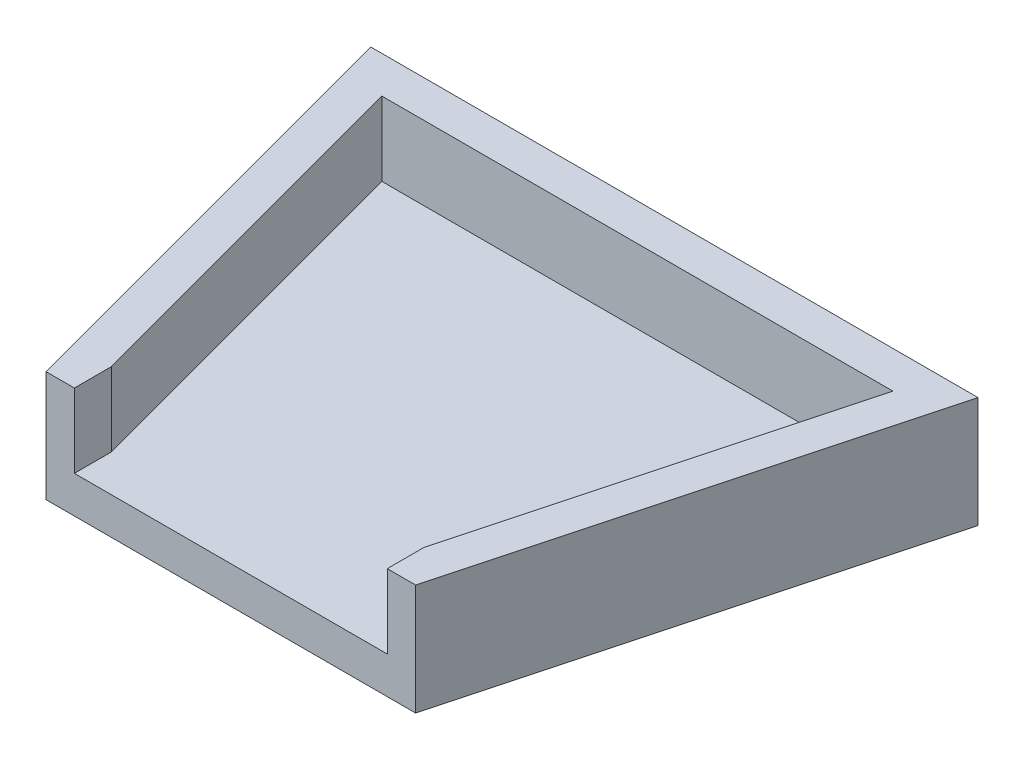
ISO-10303-21;
HEADER;
FILE_DESCRIPTION(('STEP AP214'),'2;1');
FILE_NAME('part.step','',(''),(''),'','','');
FILE_SCHEMA(('AUTOMOTIVE_DESIGN { 1 0 10303 214 1 1 1 1 }'));
ENDSEC;
DATA;
#1=APPLICATION_CONTEXT('core data for automotive mechanical design processes');
#2=APPLICATION_PROTOCOL_DEFINITION('international standard','automotive_design',2000,#1);
#3=PRODUCT_CONTEXT('',#1,'mechanical');
#4=PRODUCT('Part','Part','',(#3));
#5=PRODUCT_RELATED_PRODUCT_CATEGORY('part','',(#4));
#6=PRODUCT_DEFINITION_FORMATION('','',#4);
#7=PRODUCT_DEFINITION_CONTEXT('part definition',#1,'design');
#8=PRODUCT_DEFINITION('design','',#6,#7);
#9=PRODUCT_DEFINITION_SHAPE('','',#8);
#10=(LENGTH_UNIT() NAMED_UNIT(*) SI_UNIT(.MILLI.,.METRE.));
#11=(NAMED_UNIT(*) PLANE_ANGLE_UNIT() SI_UNIT($,.RADIAN.));
#12=(NAMED_UNIT(*) SI_UNIT($,.STERADIAN.) SOLID_ANGLE_UNIT());
#13=UNCERTAINTY_MEASURE_WITH_UNIT(LENGTH_MEASURE(1.E-05),#10,'distance_accuracy_value','');
#14=(GEOMETRIC_REPRESENTATION_CONTEXT(3) GLOBAL_UNCERTAINTY_ASSIGNED_CONTEXT((#13)) GLOBAL_UNIT_ASSIGNED_CONTEXT((#10,
#11,#12)) REPRESENTATION_CONTEXT('',''));
#15=CARTESIAN_POINT('',(0.,0.,0.));
#16=DIRECTION('',(0.,0.,1.));
#17=DIRECTION('',(1.,0.,0.));
#18=AXIS2_PLACEMENT_3D('',#15,#16,#17);
#19=CARTESIAN_POINT('',(0.,30.,0.));
#20=DIRECTION('',(0.,1.,0.));
#21=DIRECTION('',(0.,0.,1.));
#22=AXIS2_PLACEMENT_3D('',#19,#20,#21);
#23=PLANE('',#22);
#24=DIRECTION('',(0.,0.,-1.));
#25=VECTOR('',#24,1.);
#26=CARTESIAN_POINT('',(42.3267301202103,30.,50.));
#27=LINE('',#26,#25);
#28=CARTESIAN_POINT('',(42.3267301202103,30.,60.));
#29=VERTEX_POINT('',#28);
#30=CARTESIAN_POINT('',(42.3267301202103,30.,50.));
#31=VERTEX_POINT('',#30);
#32=EDGE_CURVE('E144',#29,#31,#27,.T.);
#33=ORIENTED_EDGE('',*,*,#32,.F.);
#34=DIRECTION('',(1.,0.,0.));
#35=VECTOR('',#34,1.);
#36=CARTESIAN_POINT('',(0.,30.,60.));
#37=LINE('',#36,#35);
#38=CARTESIAN_POINT('',(50.,30.,60.));
#39=VERTEX_POINT('',#38);
#40=EDGE_CURVE('E162',#29,#39,#37,.T.);
#41=ORIENTED_EDGE('',*,*,#40,.T.);
#42=DIRECTION('',(0.258819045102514,0.,-0.96592582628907));
#43=VECTOR('',#42,1.);
#44=CARTESIAN_POINT('',(61.6506350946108,30.,16.5192378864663));
#45=LINE('',#44,#43);
#46=CARTESIAN_POINT('',(82.1539030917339,30.,-60.));
#47=VERTEX_POINT('',#46);
#48=EDGE_CURVE('E165',#39,#47,#45,.T.);
#49=ORIENTED_EDGE('',*,*,#48,.T.);
#50=DIRECTION('',(-1.,0.,0.));
#51=VECTOR('',#50,1.);
#52=CARTESIAN_POINT('',(0.,30.,-60.));
#53=LINE('',#52,#51);
#54=CARTESIAN_POINT('',(-82.1539030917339,30.,-60.));
#55=VERTEX_POINT('',#54);
#56=EDGE_CURVE('E65',#47,#55,#53,.T.);
#57=ORIENTED_EDGE('',*,*,#56,.T.);
#58=DIRECTION('',(-0.258819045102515,0.,-0.96592582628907));
#59=VECTOR('',#58,1.);
#60=CARTESIAN_POINT('',(-61.6506350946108,30.,16.5192378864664));
#61=LINE('',#60,#59);
#62=CARTESIAN_POINT('',(-50.,30.,60.));
#63=VERTEX_POINT('',#62);
#64=EDGE_CURVE('E160',#63,#55,#61,.T.);
#65=ORIENTED_EDGE('',*,*,#64,.F.);
#66=CARTESIAN_POINT('',(-42.3267301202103,30.,60.));
#67=VERTEX_POINT('',#66);
#68=EDGE_CURVE('E143',#63,#67,#37,.T.);
#69=ORIENTED_EDGE('',*,*,#68,.T.);
#70=DIRECTION('',(0.,0.,1.));
#71=VECTOR('',#70,1.);
#72=CARTESIAN_POINT('',(-42.3267301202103,30.,50.));
#73=LINE('',#72,#71);
#74=CARTESIAN_POINT('',(-42.3267301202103,30.,50.));
#75=VERTEX_POINT('',#74);
#76=EDGE_CURVE('E127',#75,#67,#73,.T.);
#77=ORIENTED_EDGE('',*,*,#76,.F.);
#78=DIRECTION('',(-0.258819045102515,0.,-0.96592582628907));
#79=VECTOR('',#78,1.);
#80=CARTESIAN_POINT('',(-51.9913768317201,30.,13.9310474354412));
#81=LINE('',#80,#79);
#82=CARTESIAN_POINT('',(-69.1216493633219,30.,-50.));
#83=VERTEX_POINT('',#82);
#84=EDGE_CURVE('E142',#75,#83,#81,.T.);
#85=ORIENTED_EDGE('',*,*,#84,.T.);
#86=DIRECTION('',(-1.,0.,0.));
#87=VECTOR('',#86,1.);
#88=CARTESIAN_POINT('',(0.,30.,-50.));
#89=LINE('',#88,#87);
#90=CARTESIAN_POINT('',(69.1216493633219,30.,-50.));
#91=VERTEX_POINT('',#90);
#92=EDGE_CURVE('E152',#91,#83,#89,.T.);
#93=ORIENTED_EDGE('',*,*,#92,.F.);
#94=DIRECTION('',(0.258819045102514,0.,-0.96592582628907));
#95=VECTOR('',#94,1.);
#96=CARTESIAN_POINT('',(51.9913768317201,30.,13.9310474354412));
#97=LINE('',#96,#95);
#98=EDGE_CURVE('E149',#31,#91,#97,.T.);
#99=ORIENTED_EDGE('',*,*,#98,.F.);
#100=EDGE_LOOP('',(#33,#41,#49,#57,#65,#69,#77,#85,#93,#99));
#101=FACE_BOUND('',#100,.T.);
#102=ADVANCED_FACE('F41',(#101),#23,.T.);
#103=CARTESIAN_POINT('',(-61.6506350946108,30.,16.5192378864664));
#104=DIRECTION('',(-0.96592582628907,0.,0.258819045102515));
#105=DIRECTION('',(0.258819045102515,0.,0.96592582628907));
#106=AXIS2_PLACEMENT_3D('',#103,#104,#105);
#107=PLANE('',#106);
#108=DIRECTION('',(-0.258819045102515,0.,-0.96592582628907));
#109=VECTOR('',#108,1.);
#110=CARTESIAN_POINT('',(-61.6506350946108,0.,16.5192378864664));
#111=LINE('',#110,#109);
#112=CARTESIAN_POINT('',(-50.,0.,60.));
#113=VERTEX_POINT('',#112);
#114=CARTESIAN_POINT('',(-82.1539030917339,0.,-60.));
#115=VERTEX_POINT('',#114);
#116=EDGE_CURVE('E135',#113,#115,#111,.T.);
#117=ORIENTED_EDGE('',*,*,#116,.F.);
#118=DIRECTION('',(0.,-1.,0.));
#119=VECTOR('',#118,1.);
#120=CARTESIAN_POINT('',(-50.,30.,60.));
#121=LINE('',#120,#119);
#122=EDGE_CURVE('E11',#63,#113,#121,.T.);
#123=ORIENTED_EDGE('',*,*,#122,.F.);
#124=ORIENTED_EDGE('',*,*,#64,.T.);
#125=DIRECTION('',(0.,-1.,0.));
#126=VECTOR('',#125,1.);
#127=CARTESIAN_POINT('',(-82.1539030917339,30.,-60.));
#128=LINE('',#127,#126);
#129=EDGE_CURVE('E85',#55,#115,#128,.T.);
#130=ORIENTED_EDGE('',*,*,#129,.T.);
#131=EDGE_LOOP('',(#117,#123,#124,#130));
#132=FACE_BOUND('',#131,.T.);
#133=ADVANCED_FACE('F43',(#132),#107,.T.);
#134=CARTESIAN_POINT('',(0.,30.,60.));
#135=DIRECTION('',(0.,0.,-1.));
#136=DIRECTION('',(-1.,0.,0.));
#137=AXIS2_PLACEMENT_3D('',#134,#135,#136);
#138=PLANE('',#137);
#139=ORIENTED_EDGE('',*,*,#40,.F.);
#140=DIRECTION('',(0.,1.,0.));
#141=VECTOR('',#140,1.);
#142=CARTESIAN_POINT('',(42.3267301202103,-75.2420572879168,60.));
#143=LINE('',#142,#141);
#144=CARTESIAN_POINT('',(42.3267301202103,9.99999999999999,60.));
#145=VERTEX_POINT('',#144);
#146=EDGE_CURVE('E296',#145,#29,#143,.T.);
#147=ORIENTED_EDGE('',*,*,#146,.F.);
#148=DIRECTION('',(-1.,0.,0.));
#149=VECTOR('',#148,1.);
#150=CARTESIAN_POINT('',(42.3267301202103,9.99999999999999,60.));
#151=LINE('',#150,#149);
#152=CARTESIAN_POINT('',(-42.3267301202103,9.99999999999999,60.));
#153=VERTEX_POINT('',#152);
#154=EDGE_CURVE('E298',#145,#153,#151,.T.);
#155=ORIENTED_EDGE('',*,*,#154,.T.);
#156=DIRECTION('',(0.,1.,0.));
#157=VECTOR('',#156,1.);
#158=CARTESIAN_POINT('',(-42.3267301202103,-75.2420572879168,60.));
#159=LINE('',#158,#157);
#160=EDGE_CURVE('E294',#153,#67,#159,.T.);
#161=ORIENTED_EDGE('',*,*,#160,.T.);
#162=ORIENTED_EDGE('',*,*,#68,.F.);
#163=ORIENTED_EDGE('',*,*,#122,.T.);
#164=DIRECTION('',(1.,0.,0.));
#165=VECTOR('',#164,1.);
#166=CARTESIAN_POINT('',(0.,0.,60.));
#167=LINE('',#166,#165);
#168=CARTESIAN_POINT('',(50.,0.,60.));
#169=VERTEX_POINT('',#168);
#170=EDGE_CURVE('E170',#113,#169,#167,.T.);
#171=ORIENTED_EDGE('',*,*,#170,.T.);
#172=DIRECTION('',(0.,-1.,0.));
#173=VECTOR('',#172,1.);
#174=CARTESIAN_POINT('',(50.,30.,60.));
#175=LINE('',#174,#173);
#176=EDGE_CURVE('E49',#39,#169,#175,.T.);
#177=ORIENTED_EDGE('',*,*,#176,.F.);
#178=EDGE_LOOP('',(#139,#147,#155,#161,#162,#163,#171,#177));
#179=FACE_BOUND('',#178,.T.);
#180=ADVANCED_FACE('F194',(#179),#138,.F.);
#181=CARTESIAN_POINT('',(61.6506350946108,30.,16.5192378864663));
#182=DIRECTION('',(-0.96592582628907,0.,-0.258819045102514));
#183=DIRECTION('',(-0.258819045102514,0.,0.96592582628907));
#184=AXIS2_PLACEMENT_3D('',#181,#182,#183);
#185=PLANE('',#184);
#186=DIRECTION('',(0.258819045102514,0.,-0.96592582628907));
#187=VECTOR('',#186,1.);
#188=CARTESIAN_POINT('',(61.6506350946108,0.,16.5192378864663));
#189=LINE('',#188,#187);
#190=CARTESIAN_POINT('',(82.1539030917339,0.,-60.));
#191=VERTEX_POINT('',#190);
#192=EDGE_CURVE('E172',#169,#191,#189,.T.);
#193=ORIENTED_EDGE('',*,*,#192,.T.);
#194=DIRECTION('',(0.,-1.,0.));
#195=VECTOR('',#194,1.);
#196=CARTESIAN_POINT('',(82.1539030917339,30.,-60.));
#197=LINE('',#196,#195);
#198=EDGE_CURVE('E176',#47,#191,#197,.T.);
#199=ORIENTED_EDGE('',*,*,#198,.F.);
#200=ORIENTED_EDGE('',*,*,#48,.F.);
#201=ORIENTED_EDGE('',*,*,#176,.T.);
#202=EDGE_LOOP('',(#193,#199,#200,#201));
#203=FACE_BOUND('',#202,.T.);
#204=ADVANCED_FACE('F183',(#203),#185,.F.);
#205=CARTESIAN_POINT('',(0.,30.,-60.));
#206=DIRECTION('',(0.,0.,1.));
#207=DIRECTION('',(1.,0.,0.));
#208=AXIS2_PLACEMENT_3D('',#205,#206,#207);
#209=PLANE('',#208);
#210=DIRECTION('',(-1.,0.,0.));
#211=VECTOR('',#210,1.);
#212=CARTESIAN_POINT('',(0.,0.,-60.));
#213=LINE('',#212,#211);
#214=EDGE_CURVE('E163',#191,#115,#213,.T.);
#215=ORIENTED_EDGE('',*,*,#214,.T.);
#216=ORIENTED_EDGE('',*,*,#129,.F.);
#217=ORIENTED_EDGE('',*,*,#56,.F.);
#218=ORIENTED_EDGE('',*,*,#198,.T.);
#219=EDGE_LOOP('',(#215,#216,#217,#218));
#220=FACE_BOUND('',#219,.T.);
#221=ADVANCED_FACE('F192',(#220),#209,.F.);
#222=CARTESIAN_POINT('',(0.,0.,0.));
#223=DIRECTION('',(0.,1.,0.));
#224=DIRECTION('',(0.,0.,1.));
#225=AXIS2_PLACEMENT_3D('',#222,#223,#224);
#226=PLANE('',#225);
#227=ORIENTED_EDGE('',*,*,#116,.T.);
#228=ORIENTED_EDGE('',*,*,#214,.F.);
#229=ORIENTED_EDGE('',*,*,#192,.F.);
#230=ORIENTED_EDGE('',*,*,#170,.F.);
#231=EDGE_LOOP('',(#227,#228,#229,#230));
#232=FACE_BOUND('',#231,.T.);
#233=ADVANCED_FACE('F190',(#232),#226,.F.);
#234=CARTESIAN_POINT('',(-51.9913768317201,30.,13.9310474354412));
#235=DIRECTION('',(-0.96592582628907,0.,0.258819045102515));
#236=DIRECTION('',(0.258819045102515,0.,0.96592582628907));
#237=AXIS2_PLACEMENT_3D('',#234,#235,#236);
#238=PLANE('',#237);
#239=DIRECTION('',(-0.258819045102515,0.,-0.96592582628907));
#240=VECTOR('',#239,1.);
#241=CARTESIAN_POINT('',(-51.9913768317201,10.,13.9310474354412));
#242=LINE('',#241,#240);
#243=CARTESIAN_POINT('',(-42.3267301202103,9.99999999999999,50.));
#244=VERTEX_POINT('',#243);
#245=CARTESIAN_POINT('',(-69.1216493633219,10.,-50.));
#246=VERTEX_POINT('',#245);
#247=EDGE_CURVE('E286',#244,#246,#242,.T.);
#248=ORIENTED_EDGE('',*,*,#247,.T.);
#249=DIRECTION('',(0.,-1.,0.));
#250=VECTOR('',#249,1.);
#251=CARTESIAN_POINT('',(-69.1216493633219,30.,-50.));
#252=LINE('',#251,#250);
#253=EDGE_CURVE('E148',#83,#246,#252,.T.);
#254=ORIENTED_EDGE('',*,*,#253,.F.);
#255=ORIENTED_EDGE('',*,*,#84,.F.);
#256=DIRECTION('',(0.,-1.,0.));
#257=VECTOR('',#256,1.);
#258=CARTESIAN_POINT('',(-42.3267301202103,30.,50.));
#259=LINE('',#258,#257);
#260=EDGE_CURVE('E124',#75,#244,#259,.T.);
#261=ORIENTED_EDGE('',*,*,#260,.T.);
#262=EDGE_LOOP('',(#248,#254,#255,#261));
#263=FACE_BOUND('',#262,.T.);
#264=ADVANCED_FACE('F147',(#263),#238,.F.);
#265=CARTESIAN_POINT('',(51.9913768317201,30.,13.9310474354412));
#266=DIRECTION('',(-0.96592582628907,0.,-0.258819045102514));
#267=DIRECTION('',(-0.258819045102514,0.,0.96592582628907));
#268=AXIS2_PLACEMENT_3D('',#265,#266,#267);
#269=PLANE('',#268);
#270=DIRECTION('',(0.258819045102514,0.,-0.96592582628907));
#271=VECTOR('',#270,1.);
#272=CARTESIAN_POINT('',(51.9913768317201,10.,13.9310474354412));
#273=LINE('',#272,#271);
#274=CARTESIAN_POINT('',(42.3267301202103,10.,50.));
#275=VERTEX_POINT('',#274);
#276=CARTESIAN_POINT('',(69.1216493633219,10.,-50.));
#277=VERTEX_POINT('',#276);
#278=EDGE_CURVE('E155',#275,#277,#273,.T.);
#279=ORIENTED_EDGE('',*,*,#278,.F.);
#280=DIRECTION('',(0.,-1.,0.));
#281=VECTOR('',#280,1.);
#282=CARTESIAN_POINT('',(42.3267301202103,30.,50.));
#283=LINE('',#282,#281);
#284=EDGE_CURVE('E136',#31,#275,#283,.T.);
#285=ORIENTED_EDGE('',*,*,#284,.F.);
#286=ORIENTED_EDGE('',*,*,#98,.T.);
#287=DIRECTION('',(0.,-1.,0.));
#288=VECTOR('',#287,1.);
#289=CARTESIAN_POINT('',(69.1216493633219,30.,-50.));
#290=LINE('',#289,#288);
#291=EDGE_CURVE('E56',#91,#277,#290,.T.);
#292=ORIENTED_EDGE('',*,*,#291,.T.);
#293=EDGE_LOOP('',(#279,#285,#286,#292));
#294=FACE_BOUND('',#293,.T.);
#295=ADVANCED_FACE('F233',(#294),#269,.T.);
#296=CARTESIAN_POINT('',(0.,30.,-50.));
#297=DIRECTION('',(0.,0.,1.));
#298=DIRECTION('',(1.,0.,0.));
#299=AXIS2_PLACEMENT_3D('',#296,#297,#298);
#300=PLANE('',#299);
#301=DIRECTION('',(-1.,0.,0.));
#302=VECTOR('',#301,1.);
#303=CARTESIAN_POINT('',(0.,10.,-50.));
#304=LINE('',#303,#302);
#305=EDGE_CURVE('E150',#277,#246,#304,.T.);
#306=ORIENTED_EDGE('',*,*,#305,.F.);
#307=ORIENTED_EDGE('',*,*,#291,.F.);
#308=ORIENTED_EDGE('',*,*,#92,.T.);
#309=ORIENTED_EDGE('',*,*,#253,.T.);
#310=EDGE_LOOP('',(#306,#307,#308,#309));
#311=FACE_BOUND('',#310,.T.);
#312=ADVANCED_FACE('F230',(#311),#300,.T.);
#313=CARTESIAN_POINT('',(0.,10.,0.));
#314=DIRECTION('',(0.,1.,0.));
#315=DIRECTION('',(0.,0.,1.));
#316=AXIS2_PLACEMENT_3D('',#313,#314,#315);
#317=PLANE('',#316);
#318=ORIENTED_EDGE('',*,*,#247,.F.);
#319=DIRECTION('',(0.,0.,-1.));
#320=VECTOR('',#319,1.);
#321=CARTESIAN_POINT('',(-42.3267301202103,9.99999999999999,50.));
#322=LINE('',#321,#320);
#323=EDGE_CURVE('E130',#153,#244,#322,.T.);
#324=ORIENTED_EDGE('',*,*,#323,.F.);
#325=ORIENTED_EDGE('',*,*,#154,.F.);
#326=DIRECTION('',(0.,0.,1.));
#327=VECTOR('',#326,1.);
#328=CARTESIAN_POINT('',(42.3267301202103,9.99999999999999,50.));
#329=LINE('',#328,#327);
#330=EDGE_CURVE('E293',#275,#145,#329,.T.);
#331=ORIENTED_EDGE('',*,*,#330,.F.);
#332=ORIENTED_EDGE('',*,*,#278,.T.);
#333=ORIENTED_EDGE('',*,*,#305,.T.);
#334=EDGE_LOOP('',(#318,#324,#325,#331,#332,#333));
#335=FACE_BOUND('',#334,.T.);
#336=ADVANCED_FACE('F206',(#335),#317,.T.);
#337=CARTESIAN_POINT('',(42.3267301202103,-75.2420572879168,50.));
#338=DIRECTION('',(1.,0.,0.));
#339=DIRECTION('',(0.,0.,-1.));
#340=AXIS2_PLACEMENT_3D('',#337,#338,#339);
#341=PLANE('',#340);
#342=ORIENTED_EDGE('',*,*,#330,.T.);
#343=ORIENTED_EDGE('',*,*,#146,.T.);
#344=ORIENTED_EDGE('',*,*,#32,.T.);
#345=ORIENTED_EDGE('',*,*,#284,.T.);
#346=EDGE_LOOP('',(#342,#343,#344,#345));
#347=FACE_BOUND('',#346,.T.);
#348=ADVANCED_FACE('F247',(#347),#341,.F.);
#349=CARTESIAN_POINT('',(-42.3267301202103,-75.2420572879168,50.));
#350=DIRECTION('',(-1.,0.,0.));
#351=DIRECTION('',(0.,0.,1.));
#352=AXIS2_PLACEMENT_3D('',#349,#350,#351);
#353=PLANE('',#352);
#354=ORIENTED_EDGE('',*,*,#323,.T.);
#355=ORIENTED_EDGE('',*,*,#260,.F.);
#356=ORIENTED_EDGE('',*,*,#76,.T.);
#357=ORIENTED_EDGE('',*,*,#160,.F.);
#358=EDGE_LOOP('',(#354,#355,#356,#357));
#359=FACE_BOUND('',#358,.T.);
#360=ADVANCED_FACE('F126',(#359),#353,.F.);
#361=CLOSED_SHELL('',(#102,#133,#180,#204,#221,#233,#264,#295,#312,#336,#348,#360));
#362=MANIFOLD_SOLID_BREP('B2',#361);
#363=ADVANCED_BREP_SHAPE_REPRESENTATION('',(#18,#362),#14);
#364=SHAPE_DEFINITION_REPRESENTATION(#9,#363);
ENDSEC;
END-ISO-10303-21;
